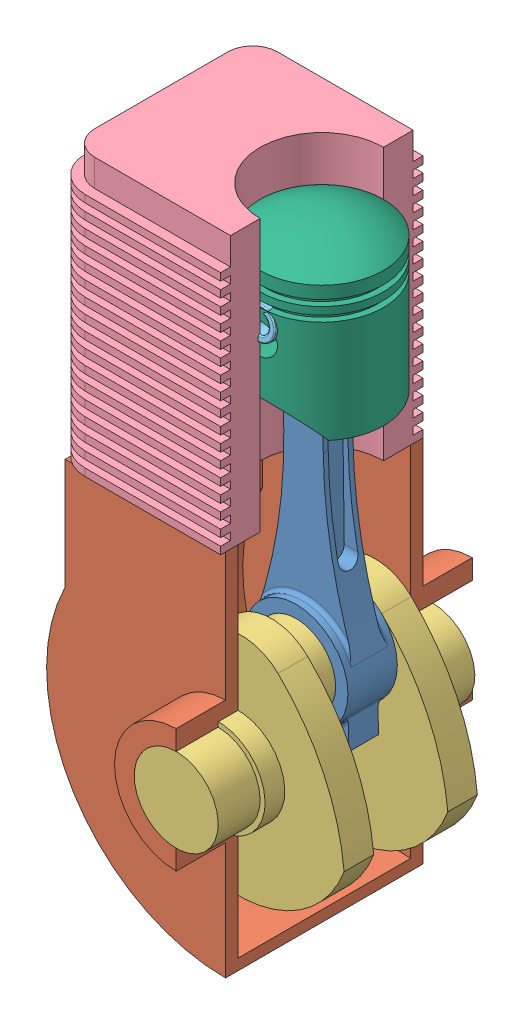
SolidWorks assembly Assem1.sldasm, configuration Default (file format 10000). Lengths in mm.
Overall size (119.37 259.5 120).
6 component instances, 6 part files, 7 mates.
Components (placement in the parent):
- 1901ME39_connecting_rod-1: 1901ME39_connecting_rod.SLDPRT [Default] at (174.6937 150.0538 83.3771) x (0.99991 0.013419 0) z (0 0 1) size (42 160.15 20)
- 1901ME39_crank_case-1: 1901ME39_crank_case.SLDPRT [Default] at (173.4015 101.4043 120.3771) size (72.5 149.5 120)
- 1901ME39_crank_shaft-1: 1901ME39_crank_shaft.SLDPRT [Default] at (173.4015 101.4043 115.3771) x (0.997923 -0.064411 0) z (0 0 1) size (88 92 104)
- 1901ME39_cylinder_yt-1: 1901ME39_cylinder_yt.SLDPRT [Default] at (173.4015 178.4043 81.3771) x (0 0 -1) z (1 0 0) size (82 110 69)
- 1901ME39_Gudgen_pin-1: 1901ME39_Gudgen_pin.SLDPRT [Default] at (173.4015 251.7199 106.6991) x (0 -0.097023 -0.995282) z (0.999993 0.003642 -0.000355) size (50 12.5 12.5)
- 1901ME39_Piston-1: 1901ME39_Piston.SLDPRT [Default] at (173.4015 215.6456 81.3771) size (50 64.17 50)
Mates (geometry in assembly coordinates):
- Coincident4: coincident anti-aligned: circle of 1901ME39_crank_case-1; circle of 1901ME39_crank_shaft-1
- Coincident5: coincident anti-aligned: line of 1901ME39_crank_case-1 through (173.4015 178.4043 40.3771) axis (-1 0 0); line of 1901ME39_cylinder_yt-1 through (118.4015 178.4043 40.3771) axis (1 0 0)
- Coincident6: coincident aligned: line of 1901ME39_crank_case-1 through (173.4015 178.4043 45.3771) axis (0 0 -1); line of 1901ME39_cylinder_yt-1 through (173.4015 178.4043 56.3771) axis (0 0 -1)
- Coincident7: coincident aligned: circle of 1901ME39_connecting_rod-1; circle of 1901ME39_Piston-1
- Tangent2: tangent: circle of 1901ME39_Gudgen_pin-1; curve of 1901ME39_Piston-1
- Concentric4: concentric anti-aligned: cylinder of 1901ME39_cylinder_yt-1 through (173.4015 288.4043 81.3771) axis (0 -1 0) radius 25; cylinder of 1901ME39_Piston-1 through (173.4015 278.1456 81.3771) axis (0 1 0) radius 25
- Concentric5: concentric anti-aligned: cylinder of 1901ME39_connecting_rod-1 through (175.0118 126.3524 93.3771) axis (0 0 -1) radius 16; cylinder of 1901ME39_crank_shaft-1 through (175.0118 126.3524 88.3771) axis (0 0 1) radius 16
